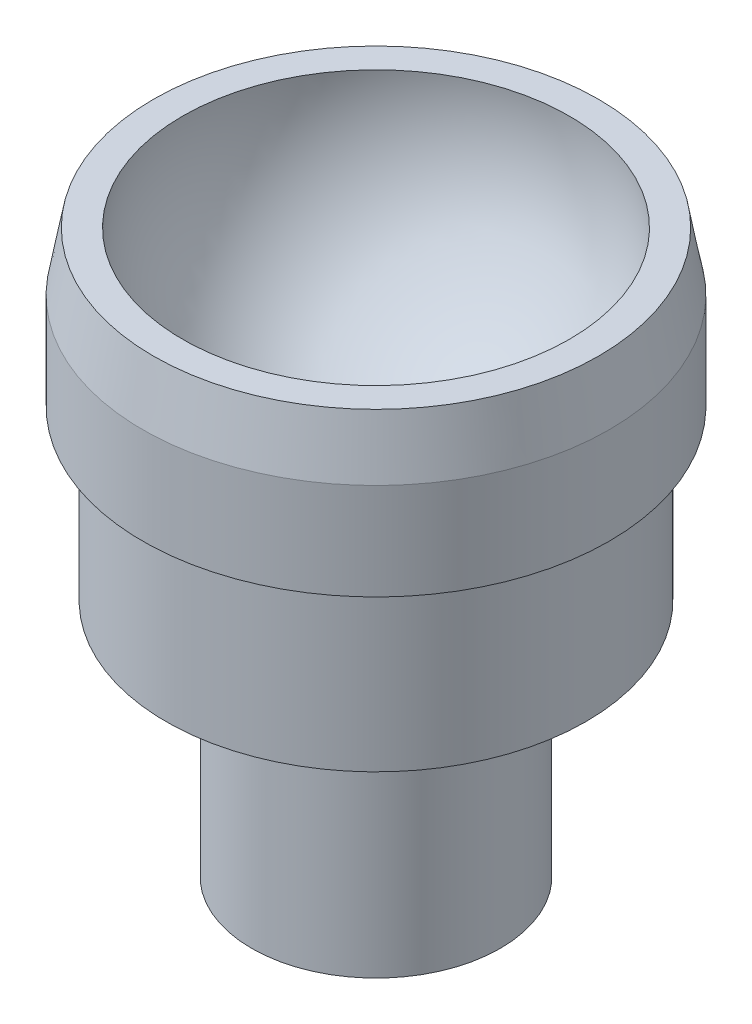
ISO-10303-21;
HEADER;
FILE_DESCRIPTION(('STEP AP214'),'2;1');
FILE_NAME('part.step','',(''),(''),'','','');
FILE_SCHEMA(('AUTOMOTIVE_DESIGN { 1 0 10303 214 1 1 1 1 }'));
ENDSEC;
DATA;
#1=APPLICATION_CONTEXT('core data for automotive mechanical design processes');
#2=APPLICATION_PROTOCOL_DEFINITION('international standard','automotive_design',2000,#1);
#3=PRODUCT_CONTEXT('',#1,'mechanical');
#4=PRODUCT('Part','Part','',(#3));
#5=PRODUCT_RELATED_PRODUCT_CATEGORY('part','',(#4));
#6=PRODUCT_DEFINITION_FORMATION('','',#4);
#7=PRODUCT_DEFINITION_CONTEXT('part definition',#1,'design');
#8=PRODUCT_DEFINITION('design','',#6,#7);
#9=PRODUCT_DEFINITION_SHAPE('','',#8);
#10=(LENGTH_UNIT() NAMED_UNIT(*) SI_UNIT(.MILLI.,.METRE.));
#11=(NAMED_UNIT(*) PLANE_ANGLE_UNIT() SI_UNIT($,.RADIAN.));
#12=(NAMED_UNIT(*) SI_UNIT($,.STERADIAN.) SOLID_ANGLE_UNIT());
#13=UNCERTAINTY_MEASURE_WITH_UNIT(LENGTH_MEASURE(1.E-05),#10,'distance_accuracy_value','');
#14=(GEOMETRIC_REPRESENTATION_CONTEXT(3) GLOBAL_UNCERTAINTY_ASSIGNED_CONTEXT((#13)) GLOBAL_UNIT_ASSIGNED_CONTEXT((#10,
#11,#12)) REPRESENTATION_CONTEXT('',''));
#15=CARTESIAN_POINT('',(0.,0.,0.));
#16=DIRECTION('',(0.,0.,1.));
#17=DIRECTION('',(1.,0.,0.));
#18=AXIS2_PLACEMENT_3D('',#15,#16,#17);
#19=CARTESIAN_POINT('',(0.,19.5,0.));
#20=DIRECTION('',(0.,-1.,0.));
#21=DIRECTION('',(1.,0.,0.));
#22=AXIS2_PLACEMENT_3D('',#19,#20,#21);
#23=SPHERICAL_SURFACE('',#22,12.5);
#24=CARTESIAN_POINT('',(0.,20.76,0.));
#25=DIRECTION('',(0.,-1.,0.));
#26=DIRECTION('',(1.,0.,0.));
#27=AXIS2_PLACEMENT_3D('',#24,#25,#26);
#28=CIRCLE('',#27,12.4363338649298);
#29=CARTESIAN_POINT('',(12.4363338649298,20.76,0.));
#30=VERTEX_POINT('',#29);
#31=EDGE_CURVE('E10',#30,#30,#28,.T.);
#32=ORIENTED_EDGE('',*,*,#31,.F.);
#33=EDGE_LOOP('',(#32));
#34=FACE_BOUND('',#33,.T.);
#35=ADVANCED_FACE('F28',(#34),#23,.F.);
#36=CARTESIAN_POINT('',(14.3090880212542,20.76,0.));
#37=DIRECTION('',(0.,1.,0.));
#38=DIRECTION('',(-1.,0.,0.));
#39=AXIS2_PLACEMENT_3D('',#36,#37,#38);
#40=PLANE('',#39);
#41=ORIENTED_EDGE('',*,*,#31,.T.);
#42=EDGE_LOOP('',(#41));
#43=FACE_BOUND('',#42,.T.);
#44=CARTESIAN_POINT('',(0.,20.76,0.));
#45=DIRECTION('',(0.,-1.,0.));
#46=DIRECTION('',(1.,0.,0.));
#47=AXIS2_PLACEMENT_3D('',#44,#45,#46);
#48=CIRCLE('',#47,14.3090880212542);
#49=CARTESIAN_POINT('',(14.3090880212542,20.76,0.));
#50=VERTEX_POINT('',#49);
#51=EDGE_CURVE('E34',#50,#50,#48,.T.);
#52=ORIENTED_EDGE('',*,*,#51,.F.);
#53=EDGE_LOOP('',(#52));
#54=FACE_BOUND('',#53,.T.);
#55=ADVANCED_FACE('F85',(#43,#54),#40,.T.);
#56=CARTESIAN_POINT('',(0.,17.01,0.));
#57=DIRECTION('',(0.,-1.,0.));
#58=DIRECTION('',(1.,0.,0.));
#59=AXIS2_PLACEMENT_3D('',#56,#57,#58);
#60=CONICAL_SURFACE('',#59,15.,0.182199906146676);
#61=ORIENTED_EDGE('',*,*,#51,.T.);
#62=EDGE_LOOP('',(#61));
#63=FACE_BOUND('',#62,.T.);
#64=CARTESIAN_POINT('',(0.,17.01,0.));
#65=DIRECTION('',(0.,-1.,0.));
#66=DIRECTION('',(1.,0.,0.));
#67=AXIS2_PLACEMENT_3D('',#64,#65,#66);
#68=CIRCLE('',#67,15.);
#69=CARTESIAN_POINT('',(15.,17.01,0.));
#70=VERTEX_POINT('',#69);
#71=EDGE_CURVE('E38',#70,#70,#68,.T.);
#72=ORIENTED_EDGE('',*,*,#71,.F.);
#73=EDGE_LOOP('',(#72));
#74=FACE_BOUND('',#73,.T.);
#75=ADVANCED_FACE('F90',(#63,#74),#60,.T.);
#76=CARTESIAN_POINT('',(0.,20.76,0.));
#77=DIRECTION('',(0.,-1.,0.));
#78=DIRECTION('',(1.,0.,0.));
#79=AXIS2_PLACEMENT_3D('',#76,#77,#78);
#80=CYLINDRICAL_SURFACE('',#79,15.);
#81=ORIENTED_EDGE('',*,*,#71,.T.);
#82=EDGE_LOOP('',(#81));
#83=FACE_BOUND('',#82,.T.);
#84=CARTESIAN_POINT('',(0.,10.8,0.));
#85=DIRECTION('',(0.,-1.,0.));
#86=DIRECTION('',(1.,0.,0.));
#87=AXIS2_PLACEMENT_3D('',#84,#85,#86);
#88=CIRCLE('',#87,15.);
#89=CARTESIAN_POINT('',(15.,10.8,0.));
#90=VERTEX_POINT('',#89);
#91=EDGE_CURVE('E42',#90,#90,#88,.T.);
#92=ORIENTED_EDGE('',*,*,#91,.F.);
#93=EDGE_LOOP('',(#92));
#94=FACE_BOUND('',#93,.T.);
#95=ADVANCED_FACE('F94',(#83,#94),#80,.T.);
#96=CARTESIAN_POINT('',(13.5,10.8,0.));
#97=DIRECTION('',(0.,-1.,0.));
#98=DIRECTION('',(1.,0.,0.));
#99=AXIS2_PLACEMENT_3D('',#96,#97,#98);
#100=PLANE('',#99);
#101=ORIENTED_EDGE('',*,*,#91,.T.);
#102=EDGE_LOOP('',(#101));
#103=FACE_BOUND('',#102,.T.);
#104=CARTESIAN_POINT('',(0.,10.8,0.));
#105=DIRECTION('',(0.,-1.,0.));
#106=DIRECTION('',(1.,0.,0.));
#107=AXIS2_PLACEMENT_3D('',#104,#105,#106);
#108=CIRCLE('',#107,13.5);
#109=CARTESIAN_POINT('',(13.5,10.8,0.));
#110=VERTEX_POINT('',#109);
#111=EDGE_CURVE('E47',#110,#110,#108,.T.);
#112=ORIENTED_EDGE('',*,*,#111,.F.);
#113=EDGE_LOOP('',(#112));
#114=FACE_BOUND('',#113,.T.);
#115=ADVANCED_FACE('F100',(#103,#114),#100,.T.);
#116=CARTESIAN_POINT('',(0.,20.76,0.));
#117=DIRECTION('',(0.,-1.,0.));
#118=DIRECTION('',(1.,0.,0.));
#119=AXIS2_PLACEMENT_3D('',#116,#117,#118);
#120=CYLINDRICAL_SURFACE('',#119,13.5);
#121=ORIENTED_EDGE('',*,*,#111,.T.);
#122=EDGE_LOOP('',(#121));
#123=FACE_BOUND('',#122,.T.);
#124=CARTESIAN_POINT('',(0.,0.,0.));
#125=DIRECTION('',(0.,-1.,0.));
#126=DIRECTION('',(1.,0.,0.));
#127=AXIS2_PLACEMENT_3D('',#124,#125,#126);
#128=CIRCLE('',#127,13.5);
#129=CARTESIAN_POINT('',(13.5,0.,0.));
#130=VERTEX_POINT('',#129);
#131=EDGE_CURVE('E50',#130,#130,#128,.T.);
#132=ORIENTED_EDGE('',*,*,#131,.F.);
#133=EDGE_LOOP('',(#132));
#134=FACE_BOUND('',#133,.T.);
#135=ADVANCED_FACE('F104',(#123,#134),#120,.T.);
#136=CARTESIAN_POINT('',(6.91732352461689,0.,0.));
#137=DIRECTION('',(0.,-1.,0.));
#138=DIRECTION('',(1.,0.,0.));
#139=AXIS2_PLACEMENT_3D('',#136,#137,#138);
#140=PLANE('',#139);
#141=ORIENTED_EDGE('',*,*,#131,.T.);
#142=EDGE_LOOP('',(#141));
#143=FACE_BOUND('',#142,.T.);
#144=CARTESIAN_POINT('',(0.,0.,0.));
#145=DIRECTION('',(0.,-1.,0.));
#146=DIRECTION('',(1.,0.,0.));
#147=AXIS2_PLACEMENT_3D('',#144,#145,#146);
#148=CIRCLE('',#147,6.91732352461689);
#149=CARTESIAN_POINT('',(6.91732352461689,0.,0.));
#150=VERTEX_POINT('',#149);
#151=EDGE_CURVE('E53',#150,#150,#148,.T.);
#152=ORIENTED_EDGE('',*,*,#151,.F.);
#153=EDGE_LOOP('',(#152));
#154=FACE_BOUND('',#153,.T.);
#155=ADVANCED_FACE('F108',(#143,#154),#140,.T.);
#156=CARTESIAN_POINT('',(0.,20.76,0.));
#157=DIRECTION('',(0.,-1.,0.));
#158=DIRECTION('',(1.,0.,0.));
#159=AXIS2_PLACEMENT_3D('',#156,#157,#158);
#160=CYLINDRICAL_SURFACE('',#159,6.91732352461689);
#161=ORIENTED_EDGE('',*,*,#151,.T.);
#162=EDGE_LOOP('',(#161));
#163=FACE_BOUND('',#162,.T.);
#164=CARTESIAN_POINT('',(0.,-1.6,0.));
#165=DIRECTION('',(0.,-1.,0.));
#166=DIRECTION('',(1.,0.,0.));
#167=AXIS2_PLACEMENT_3D('',#164,#165,#166);
#168=CIRCLE('',#167,6.91732352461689);
#169=CARTESIAN_POINT('',(6.91732352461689,-1.6,0.));
#170=VERTEX_POINT('',#169);
#171=EDGE_CURVE('E56',#170,#170,#168,.T.);
#172=ORIENTED_EDGE('',*,*,#171,.F.);
#173=EDGE_LOOP('',(#172));
#174=FACE_BOUND('',#173,.T.);
#175=ADVANCED_FACE('F112',(#163,#174),#160,.T.);
#176=CARTESIAN_POINT('',(0.,-2.22508355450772,0.));
#177=DIRECTION('',(0.,-1.,0.));
#178=DIRECTION('',(1.,0.,0.));
#179=AXIS2_PLACEMENT_3D('',#176,#177,#178);
#180=CONICAL_SURFACE('',#179,8.,1.04719755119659);
#181=ORIENTED_EDGE('',*,*,#171,.T.);
#182=EDGE_LOOP('',(#181));
#183=FACE_BOUND('',#182,.T.);
#184=CARTESIAN_POINT('',(0.,-2.22508355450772,0.));
#185=DIRECTION('',(0.,-1.,0.));
#186=DIRECTION('',(1.,0.,0.));
#187=AXIS2_PLACEMENT_3D('',#184,#185,#186);
#188=CIRCLE('',#187,8.);
#189=CARTESIAN_POINT('',(8.,-2.22508355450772,0.));
#190=VERTEX_POINT('',#189);
#191=EDGE_CURVE('E59',#190,#190,#188,.T.);
#192=ORIENTED_EDGE('',*,*,#191,.F.);
#193=EDGE_LOOP('',(#192));
#194=FACE_BOUND('',#193,.T.);
#195=ADVANCED_FACE('F81',(#183,#194),#180,.T.);
#196=CARTESIAN_POINT('',(0.,20.76,0.));
#197=DIRECTION('',(0.,-1.,0.));
#198=DIRECTION('',(1.,0.,0.));
#199=AXIS2_PLACEMENT_3D('',#196,#197,#198);
#200=CYLINDRICAL_SURFACE('',#199,8.);
#201=ORIENTED_EDGE('',*,*,#191,.T.);
#202=EDGE_LOOP('',(#201));
#203=FACE_BOUND('',#202,.T.);
#204=CARTESIAN_POINT('',(0.,-15.3749164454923,0.));
#205=DIRECTION('',(0.,-1.,0.));
#206=DIRECTION('',(1.,0.,0.));
#207=AXIS2_PLACEMENT_3D('',#204,#205,#206);
#208=CIRCLE('',#207,8.);
#209=CARTESIAN_POINT('',(8.,-15.3749164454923,0.));
#210=VERTEX_POINT('',#209);
#211=EDGE_CURVE('E62',#210,#210,#208,.T.);
#212=ORIENTED_EDGE('',*,*,#211,.F.);
#213=EDGE_LOOP('',(#212));
#214=FACE_BOUND('',#213,.T.);
#215=ADVANCED_FACE('F73',(#203,#214),#200,.T.);
#216=CARTESIAN_POINT('',(0.,-16.,0.));
#217=DIRECTION('',(0.,1.,0.));
#218=DIRECTION('',(-1.,0.,0.));
#219=AXIS2_PLACEMENT_3D('',#216,#217,#218);
#220=CONICAL_SURFACE('',#219,6.91732352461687,1.04719755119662);
#221=ORIENTED_EDGE('',*,*,#211,.T.);
#222=EDGE_LOOP('',(#221));
#223=FACE_BOUND('',#222,.T.);
#224=CARTESIAN_POINT('',(0.,-16.,0.));
#225=DIRECTION('',(0.,-1.,0.));
#226=DIRECTION('',(1.,0.,0.));
#227=AXIS2_PLACEMENT_3D('',#224,#225,#226);
#228=CIRCLE('',#227,6.91732352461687);
#229=CARTESIAN_POINT('',(6.91732352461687,-16.,0.));
#230=VERTEX_POINT('',#229);
#231=EDGE_CURVE('E65',#230,#230,#228,.T.);
#232=ORIENTED_EDGE('',*,*,#231,.F.);
#233=EDGE_LOOP('',(#232));
#234=FACE_BOUND('',#233,.T.);
#235=ADVANCED_FACE('F71',(#223,#234),#220,.T.);
#236=CARTESIAN_POINT('',(0.,-16.,0.));
#237=DIRECTION('',(0.,-1.,0.));
#238=DIRECTION('',(1.,0.,0.));
#239=AXIS2_PLACEMENT_3D('',#236,#237,#238);
#240=PLANE('',#239);
#241=ORIENTED_EDGE('',*,*,#231,.T.);
#242=EDGE_LOOP('',(#241));
#243=FACE_BOUND('',#242,.T.);
#244=ADVANCED_FACE('F69',(#243),#240,.T.);
#245=CLOSED_SHELL('',(#35,#55,#75,#95,#115,#135,#155,#175,#195,#215,#235,#244));
#246=MANIFOLD_SOLID_BREP('B2',#245);
#247=ADVANCED_BREP_SHAPE_REPRESENTATION('',(#18,#246),#14);
#248=SHAPE_DEFINITION_REPRESENTATION(#9,#247);
ENDSEC;
END-ISO-10303-21;
